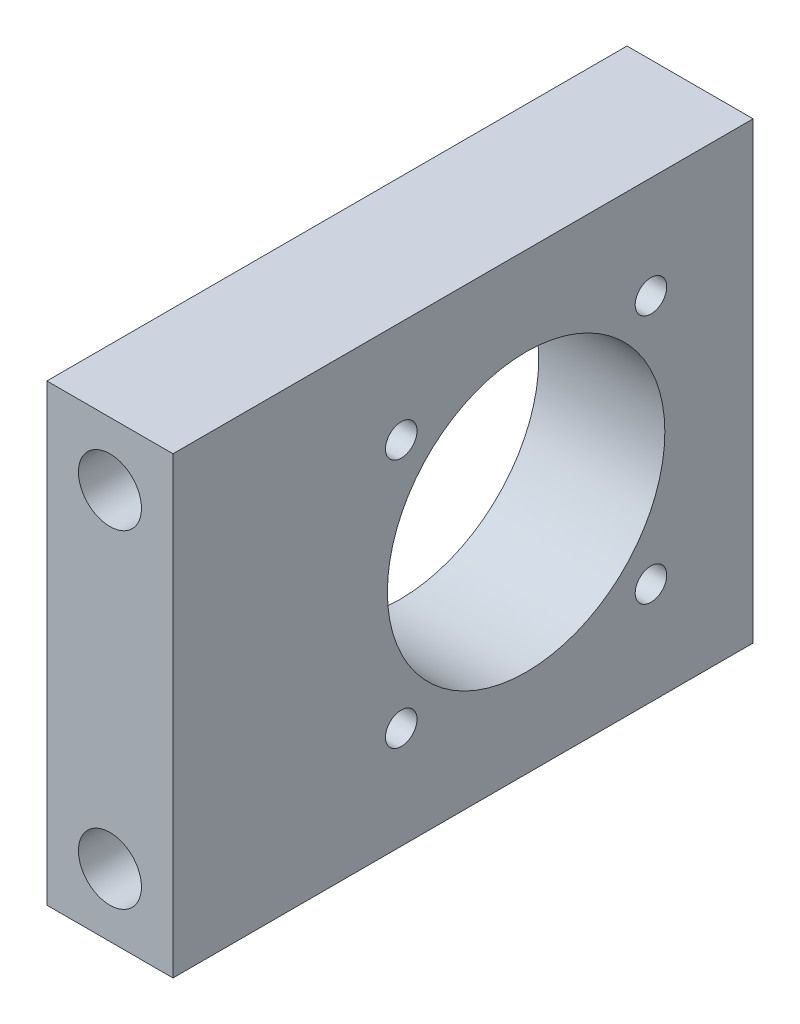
ISO-10303-21;
HEADER;
FILE_DESCRIPTION(('STEP AP214'),'2;1');
FILE_NAME('part.step','',(''),(''),'','','');
FILE_SCHEMA(('AUTOMOTIVE_DESIGN { 1 0 10303 214 1 1 1 1 }'));
ENDSEC;
DATA;
#1=APPLICATION_CONTEXT('core data for automotive mechanical design processes');
#2=APPLICATION_PROTOCOL_DEFINITION('international standard','automotive_design',2000,#1);
#3=PRODUCT_CONTEXT('',#1,'mechanical');
#4=PRODUCT('Part','Part','',(#3));
#5=PRODUCT_RELATED_PRODUCT_CATEGORY('part','',(#4));
#6=PRODUCT_DEFINITION_FORMATION('','',#4);
#7=PRODUCT_DEFINITION_CONTEXT('part definition',#1,'design');
#8=PRODUCT_DEFINITION('design','',#6,#7);
#9=PRODUCT_DEFINITION_SHAPE('','',#8);
#10=(LENGTH_UNIT() NAMED_UNIT(*) SI_UNIT(.MILLI.,.METRE.));
#11=(NAMED_UNIT(*) PLANE_ANGLE_UNIT() SI_UNIT($,.RADIAN.));
#12=(NAMED_UNIT(*) SI_UNIT($,.STERADIAN.) SOLID_ANGLE_UNIT());
#13=UNCERTAINTY_MEASURE_WITH_UNIT(LENGTH_MEASURE(1.E-05),#10,'distance_accuracy_value','');
#14=(GEOMETRIC_REPRESENTATION_CONTEXT(3) GLOBAL_UNCERTAINTY_ASSIGNED_CONTEXT((#13)) GLOBAL_UNIT_ASSIGNED_CONTEXT((#10,
#11,#12)) REPRESENTATION_CONTEXT('',''));
#15=CARTESIAN_POINT('',(0.,0.,0.));
#16=DIRECTION('',(0.,0.,1.));
#17=DIRECTION('',(1.,0.,0.));
#18=AXIS2_PLACEMENT_3D('',#15,#16,#17);
#19=CARTESIAN_POINT('',(10.,0.,0.));
#20=DIRECTION('',(1.,0.,0.));
#21=DIRECTION('',(0.,0.,-1.));
#22=AXIS2_PLACEMENT_3D('',#19,#20,#21);
#23=PLANE('',#22);
#24=CARTESIAN_POINT('',(10.,-9.89949493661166,-9.89949493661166));
#25=DIRECTION('',(1.,0.,0.));
#26=DIRECTION('',(0.,0.,-1.));
#27=AXIS2_PLACEMENT_3D('',#24,#25,#26);
#28=CIRCLE('',#27,1.24999999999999);
#29=CARTESIAN_POINT('',(10.,-9.89949493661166,-11.1494949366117));
#30=VERTEX_POINT('',#29);
#31=EDGE_CURVE('E199',#30,#30,#28,.T.);
#32=ORIENTED_EDGE('',*,*,#31,.F.);
#33=EDGE_LOOP('',(#32));
#34=FACE_BOUND('',#33,.T.);
#35=CARTESIAN_POINT('',(10.,-9.89949493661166,9.89949493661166));
#36=DIRECTION('',(1.,0.,0.));
#37=DIRECTION('',(0.,0.,-1.));
#38=AXIS2_PLACEMENT_3D('',#35,#36,#37);
#39=CIRCLE('',#38,1.24999999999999);
#40=CARTESIAN_POINT('',(10.,-9.89949493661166,8.64949493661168));
#41=VERTEX_POINT('',#40);
#42=EDGE_CURVE('E201',#41,#41,#39,.T.);
#43=ORIENTED_EDGE('',*,*,#42,.F.);
#44=EDGE_LOOP('',(#43));
#45=FACE_BOUND('',#44,.T.);
#46=CARTESIAN_POINT('',(10.,9.89949493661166,9.89949493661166));
#47=DIRECTION('',(1.,0.,0.));
#48=DIRECTION('',(0.,0.,-1.));
#49=AXIS2_PLACEMENT_3D('',#46,#47,#48);
#50=CIRCLE('',#49,1.24999999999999);
#51=CARTESIAN_POINT('',(10.,9.89949493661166,8.64949493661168));
#52=VERTEX_POINT('',#51);
#53=EDGE_CURVE('E209',#52,#52,#50,.T.);
#54=ORIENTED_EDGE('',*,*,#53,.F.);
#55=EDGE_LOOP('',(#54));
#56=FACE_BOUND('',#55,.T.);
#57=CARTESIAN_POINT('',(10.,9.89949493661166,-9.89949493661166));
#58=DIRECTION('',(1.,0.,0.));
#59=DIRECTION('',(0.,0.,-1.));
#60=AXIS2_PLACEMENT_3D('',#57,#58,#59);
#61=CIRCLE('',#60,1.24999999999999);
#62=CARTESIAN_POINT('',(10.,9.89949493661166,-11.1494949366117));
#63=VERTEX_POINT('',#62);
#64=EDGE_CURVE('E215',#63,#63,#61,.T.);
#65=ORIENTED_EDGE('',*,*,#64,.F.);
#66=EDGE_LOOP('',(#65));
#67=FACE_BOUND('',#66,.T.);
#68=DIRECTION('',(0.,-1.,0.));
#69=VECTOR('',#68,1.);
#70=CARTESIAN_POINT('',(10.,18.,28.));
#71=LINE('',#70,#69);
#72=CARTESIAN_POINT('',(10.,18.,28.));
#73=VERTEX_POINT('',#72);
#74=CARTESIAN_POINT('',(10.,-18.,28.));
#75=VERTEX_POINT('',#74);
#76=EDGE_CURVE('E121',#73,#75,#71,.T.);
#77=ORIENTED_EDGE('',*,*,#76,.T.);
#78=DIRECTION('',(0.,0.,-1.));
#79=VECTOR('',#78,1.);
#80=CARTESIAN_POINT('',(10.,-18.,28.));
#81=LINE('',#80,#79);
#82=CARTESIAN_POINT('',(10.,-18.,-18.));
#83=VERTEX_POINT('',#82);
#84=EDGE_CURVE('E84',#75,#83,#81,.T.);
#85=ORIENTED_EDGE('',*,*,#84,.T.);
#86=DIRECTION('',(0.,1.,0.));
#87=VECTOR('',#86,1.);
#88=CARTESIAN_POINT('',(10.,-18.,-18.));
#89=LINE('',#88,#87);
#90=CARTESIAN_POINT('',(10.,18.,-18.));
#91=VERTEX_POINT('',#90);
#92=EDGE_CURVE('E124',#83,#91,#89,.T.);
#93=ORIENTED_EDGE('',*,*,#92,.T.);
#94=DIRECTION('',(0.,0.,1.));
#95=VECTOR('',#94,1.);
#96=CARTESIAN_POINT('',(10.,18.,-18.));
#97=LINE('',#96,#95);
#98=EDGE_CURVE('E53',#91,#73,#97,.T.);
#99=ORIENTED_EDGE('',*,*,#98,.T.);
#100=EDGE_LOOP('',(#77,#85,#93,#99));
#101=FACE_BOUND('',#100,.T.);
#102=CARTESIAN_POINT('',(10.,0.,0.));
#103=DIRECTION('',(1.,0.,0.));
#104=DIRECTION('',(0.,0.,-1.));
#105=AXIS2_PLACEMENT_3D('',#102,#103,#104);
#106=CIRCLE('',#105,11.);
#107=CARTESIAN_POINT('',(10.,0.,-11.));
#108=VERTEX_POINT('',#107);
#109=EDGE_CURVE('E115',#108,#108,#106,.T.);
#110=ORIENTED_EDGE('',*,*,#109,.F.);
#111=EDGE_LOOP('',(#110));
#112=FACE_BOUND('',#111,.T.);
#113=ADVANCED_FACE('F36',(#34,#45,#56,#67,#101,#112),#23,.T.);
#114=CARTESIAN_POINT('',(0.,0.,0.));
#115=DIRECTION('',(1.,0.,0.));
#116=DIRECTION('',(0.,0.,-1.));
#117=AXIS2_PLACEMENT_3D('',#114,#115,#116);
#118=PLANE('',#117);
#119=CARTESIAN_POINT('',(0.,-9.89949493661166,-9.89949493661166));
#120=DIRECTION('',(1.,0.,0.));
#121=DIRECTION('',(0.,0.,-1.));
#122=AXIS2_PLACEMENT_3D('',#119,#120,#121);
#123=CIRCLE('',#122,1.25);
#124=CARTESIAN_POINT('',(0.,-9.89949493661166,-11.1494949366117));
#125=VERTEX_POINT('',#124);
#126=EDGE_CURVE('E197',#125,#125,#123,.T.);
#127=ORIENTED_EDGE('',*,*,#126,.T.);
#128=EDGE_LOOP('',(#127));
#129=FACE_BOUND('',#128,.T.);
#130=CARTESIAN_POINT('',(0.,-9.89949493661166,9.89949493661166));
#131=DIRECTION('',(1.,0.,0.));
#132=DIRECTION('',(0.,0.,-1.));
#133=AXIS2_PLACEMENT_3D('',#130,#131,#132);
#134=CIRCLE('',#133,1.25);
#135=CARTESIAN_POINT('',(0.,-9.89949493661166,8.64949493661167));
#136=VERTEX_POINT('',#135);
#137=EDGE_CURVE('E206',#136,#136,#134,.T.);
#138=ORIENTED_EDGE('',*,*,#137,.T.);
#139=EDGE_LOOP('',(#138));
#140=FACE_BOUND('',#139,.T.);
#141=CARTESIAN_POINT('',(0.,9.89949493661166,9.89949493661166));
#142=DIRECTION('',(1.,0.,0.));
#143=DIRECTION('',(0.,0.,-1.));
#144=AXIS2_PLACEMENT_3D('',#141,#142,#143);
#145=CIRCLE('',#144,1.25);
#146=CARTESIAN_POINT('',(0.,9.89949493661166,8.64949493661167));
#147=VERTEX_POINT('',#146);
#148=EDGE_CURVE('E212',#147,#147,#145,.T.);
#149=ORIENTED_EDGE('',*,*,#148,.T.);
#150=EDGE_LOOP('',(#149));
#151=FACE_BOUND('',#150,.T.);
#152=CARTESIAN_POINT('',(0.,9.89949493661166,-9.89949493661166));
#153=DIRECTION('',(1.,0.,0.));
#154=DIRECTION('',(0.,0.,-1.));
#155=AXIS2_PLACEMENT_3D('',#152,#153,#154);
#156=CIRCLE('',#155,1.25);
#157=CARTESIAN_POINT('',(0.,9.89949493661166,-11.1494949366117));
#158=VERTEX_POINT('',#157);
#159=EDGE_CURVE('E108',#158,#158,#156,.T.);
#160=ORIENTED_EDGE('',*,*,#159,.T.);
#161=EDGE_LOOP('',(#160));
#162=FACE_BOUND('',#161,.T.);
#163=DIRECTION('',(0.,-1.,0.));
#164=VECTOR('',#163,1.);
#165=CARTESIAN_POINT('',(0.,18.,28.));
#166=LINE('',#165,#164);
#167=CARTESIAN_POINT('',(0.,18.,28.));
#168=VERTEX_POINT('',#167);
#169=CARTESIAN_POINT('',(0.,-18.,28.));
#170=VERTEX_POINT('',#169);
#171=EDGE_CURVE('E118',#168,#170,#166,.T.);
#172=ORIENTED_EDGE('',*,*,#171,.F.);
#173=DIRECTION('',(0.,0.,1.));
#174=VECTOR('',#173,1.);
#175=CARTESIAN_POINT('',(0.,18.,-18.));
#176=LINE('',#175,#174);
#177=CARTESIAN_POINT('',(0.,18.,-18.));
#178=VERTEX_POINT('',#177);
#179=EDGE_CURVE('E77',#178,#168,#176,.T.);
#180=ORIENTED_EDGE('',*,*,#179,.F.);
#181=DIRECTION('',(0.,1.,0.));
#182=VECTOR('',#181,1.);
#183=CARTESIAN_POINT('',(0.,-18.,-18.));
#184=LINE('',#183,#182);
#185=CARTESIAN_POINT('',(0.,-18.,-18.));
#186=VERTEX_POINT('',#185);
#187=EDGE_CURVE('E71',#186,#178,#184,.T.);
#188=ORIENTED_EDGE('',*,*,#187,.F.);
#189=DIRECTION('',(0.,0.,-1.));
#190=VECTOR('',#189,1.);
#191=CARTESIAN_POINT('',(0.,-18.,28.));
#192=LINE('',#191,#190);
#193=EDGE_CURVE('E130',#170,#186,#192,.T.);
#194=ORIENTED_EDGE('',*,*,#193,.F.);
#195=EDGE_LOOP('',(#172,#180,#188,#194));
#196=FACE_BOUND('',#195,.T.);
#197=CARTESIAN_POINT('',(0.,0.,0.));
#198=DIRECTION('',(1.,0.,0.));
#199=DIRECTION('',(0.,0.,-1.));
#200=AXIS2_PLACEMENT_3D('',#197,#198,#199);
#201=CIRCLE('',#200,11.);
#202=CARTESIAN_POINT('',(0.,0.,-11.));
#203=VERTEX_POINT('',#202);
#204=EDGE_CURVE('E114',#203,#203,#201,.T.);
#205=ORIENTED_EDGE('',*,*,#204,.T.);
#206=EDGE_LOOP('',(#205));
#207=FACE_BOUND('',#206,.T.);
#208=ADVANCED_FACE('F140',(#129,#140,#151,#162,#196,#207),#118,.F.);
#209=CARTESIAN_POINT('',(10.,18.,28.));
#210=DIRECTION('',(0.,0.,-1.));
#211=DIRECTION('',(0.,1.,0.));
#212=AXIS2_PLACEMENT_3D('',#209,#210,#211);
#213=PLANE('',#212);
#214=CARTESIAN_POINT('',(5.,13.,28.));
#215=DIRECTION('',(0.,0.,1.));
#216=DIRECTION('',(1.,0.,0.));
#217=AXIS2_PLACEMENT_3D('',#214,#215,#216);
#218=CIRCLE('',#217,2.5);
#219=CARTESIAN_POINT('',(7.5,13.,28.));
#220=VERTEX_POINT('',#219);
#221=EDGE_CURVE('E102',#220,#220,#218,.T.);
#222=ORIENTED_EDGE('',*,*,#221,.F.);
#223=EDGE_LOOP('',(#222));
#224=FACE_BOUND('',#223,.T.);
#225=CARTESIAN_POINT('',(5.,-13.,28.));
#226=DIRECTION('',(0.,0.,1.));
#227=DIRECTION('',(1.,0.,0.));
#228=AXIS2_PLACEMENT_3D('',#225,#226,#227);
#229=CIRCLE('',#228,2.5);
#230=CARTESIAN_POINT('',(7.5,-13.,28.));
#231=VERTEX_POINT('',#230);
#232=EDGE_CURVE('E101',#231,#231,#229,.T.);
#233=ORIENTED_EDGE('',*,*,#232,.F.);
#234=EDGE_LOOP('',(#233));
#235=FACE_BOUND('',#234,.T.);
#236=ORIENTED_EDGE('',*,*,#171,.T.);
#237=DIRECTION('',(-1.,0.,0.));
#238=VECTOR('',#237,1.);
#239=CARTESIAN_POINT('',(10.,-18.,28.));
#240=LINE('',#239,#238);
#241=EDGE_CURVE('E11',#75,#170,#240,.T.);
#242=ORIENTED_EDGE('',*,*,#241,.F.);
#243=ORIENTED_EDGE('',*,*,#76,.F.);
#244=DIRECTION('',(-1.,0.,0.));
#245=VECTOR('',#244,1.);
#246=CARTESIAN_POINT('',(10.,18.,28.));
#247=LINE('',#246,#245);
#248=EDGE_CURVE('E127',#73,#168,#247,.T.);
#249=ORIENTED_EDGE('',*,*,#248,.T.);
#250=EDGE_LOOP('',(#236,#242,#243,#249));
#251=FACE_BOUND('',#250,.T.);
#252=ADVANCED_FACE('F38',(#224,#235,#251),#213,.F.);
#253=CARTESIAN_POINT('',(10.,-18.,28.));
#254=DIRECTION('',(0.,1.,0.));
#255=DIRECTION('',(0.,0.,1.));
#256=AXIS2_PLACEMENT_3D('',#253,#254,#255);
#257=PLANE('',#256);
#258=ORIENTED_EDGE('',*,*,#193,.T.);
#259=DIRECTION('',(-1.,0.,0.));
#260=VECTOR('',#259,1.);
#261=CARTESIAN_POINT('',(10.,-18.,-18.));
#262=LINE('',#261,#260);
#263=EDGE_CURVE('E45',#83,#186,#262,.T.);
#264=ORIENTED_EDGE('',*,*,#263,.F.);
#265=ORIENTED_EDGE('',*,*,#84,.F.);
#266=ORIENTED_EDGE('',*,*,#241,.T.);
#267=EDGE_LOOP('',(#258,#264,#265,#266));
#268=FACE_BOUND('',#267,.T.);
#269=ADVANCED_FACE('F156',(#268),#257,.F.);
#270=CARTESIAN_POINT('',(10.,-18.,-18.));
#271=DIRECTION('',(0.,0.,1.));
#272=DIRECTION('',(1.,0.,0.));
#273=AXIS2_PLACEMENT_3D('',#270,#271,#272);
#274=PLANE('',#273);
#275=ORIENTED_EDGE('',*,*,#187,.T.);
#276=DIRECTION('',(-1.,0.,0.));
#277=VECTOR('',#276,1.);
#278=CARTESIAN_POINT('',(10.,18.,-18.));
#279=LINE('',#278,#277);
#280=EDGE_CURVE('E135',#91,#178,#279,.T.);
#281=ORIENTED_EDGE('',*,*,#280,.F.);
#282=ORIENTED_EDGE('',*,*,#92,.F.);
#283=ORIENTED_EDGE('',*,*,#263,.T.);
#284=EDGE_LOOP('',(#275,#281,#282,#283));
#285=FACE_BOUND('',#284,.T.);
#286=ADVANCED_FACE('F137',(#285),#274,.F.);
#287=CARTESIAN_POINT('',(10.,18.,-18.));
#288=DIRECTION('',(0.,-1.,0.));
#289=DIRECTION('',(0.,0.,-1.));
#290=AXIS2_PLACEMENT_3D('',#287,#288,#289);
#291=PLANE('',#290);
#292=ORIENTED_EDGE('',*,*,#179,.T.);
#293=ORIENTED_EDGE('',*,*,#248,.F.);
#294=ORIENTED_EDGE('',*,*,#98,.F.);
#295=ORIENTED_EDGE('',*,*,#280,.T.);
#296=EDGE_LOOP('',(#292,#293,#294,#295));
#297=FACE_BOUND('',#296,.T.);
#298=ADVANCED_FACE('F145',(#297),#291,.F.);
#299=CARTESIAN_POINT('',(10.,0.,0.));
#300=DIRECTION('',(-1.,0.,0.));
#301=DIRECTION('',(0.,0.,1.));
#302=AXIS2_PLACEMENT_3D('',#299,#300,#301);
#303=CYLINDRICAL_SURFACE('',#302,11.);
#304=ORIENTED_EDGE('',*,*,#109,.T.);
#305=EDGE_LOOP('',(#304));
#306=FACE_BOUND('',#305,.T.);
#307=ORIENTED_EDGE('',*,*,#204,.F.);
#308=EDGE_LOOP('',(#307));
#309=FACE_BOUND('',#308,.T.);
#310=ADVANCED_FACE('F147',(#306,#309),#303,.F.);
#311=CARTESIAN_POINT('',(5.,-13.,13.));
#312=DIRECTION('',(0.,0.,1.));
#313=DIRECTION('',(1.,0.,0.));
#314=AXIS2_PLACEMENT_3D('',#311,#312,#313);
#315=CONICAL_SURFACE('',#314,2.5,1.02974425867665);
#316=CARTESIAN_POINT('',(5.,-13.,11.4978484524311));
#317=VERTEX_POINT('',#316);
#318=VERTEX_LOOP('',#317);
#319=FACE_BOUND('',#318,.T.);
#320=CARTESIAN_POINT('',(5.,-13.,13.));
#321=DIRECTION('',(0.,0.,1.));
#322=DIRECTION('',(1.,0.,0.));
#323=AXIS2_PLACEMENT_3D('',#320,#321,#322);
#324=CIRCLE('',#323,2.5);
#325=CARTESIAN_POINT('',(7.5,-13.,13.));
#326=VERTEX_POINT('',#325);
#327=EDGE_CURVE('E105',#326,#326,#324,.T.);
#328=ORIENTED_EDGE('',*,*,#327,.T.);
#329=EDGE_LOOP('',(#328));
#330=FACE_BOUND('',#329,.T.);
#331=ADVANCED_FACE('F153',(#319,#330),#315,.F.);
#332=CARTESIAN_POINT('',(5.,-13.,28.));
#333=DIRECTION('',(0.,0.,1.));
#334=DIRECTION('',(1.,0.,0.));
#335=AXIS2_PLACEMENT_3D('',#332,#333,#334);
#336=CYLINDRICAL_SURFACE('',#335,2.5);
#337=ORIENTED_EDGE('',*,*,#327,.F.);
#338=EDGE_LOOP('',(#337));
#339=FACE_BOUND('',#338,.T.);
#340=ORIENTED_EDGE('',*,*,#232,.T.);
#341=EDGE_LOOP('',(#340));
#342=FACE_BOUND('',#341,.T.);
#343=ADVANCED_FACE('F95',(#339,#342),#336,.F.);
#344=CARTESIAN_POINT('',(5.,13.,13.));
#345=DIRECTION('',(0.,0.,1.));
#346=DIRECTION('',(1.,0.,0.));
#347=AXIS2_PLACEMENT_3D('',#344,#345,#346);
#348=CONICAL_SURFACE('',#347,2.5,1.02974425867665);
#349=CARTESIAN_POINT('',(4.99999999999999,13.,11.4978484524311));
#350=VERTEX_POINT('',#349);
#351=VERTEX_LOOP('',#350);
#352=FACE_BOUND('',#351,.T.);
#353=CARTESIAN_POINT('',(5.,13.,13.));
#354=DIRECTION('',(0.,0.,1.));
#355=DIRECTION('',(1.,0.,0.));
#356=AXIS2_PLACEMENT_3D('',#353,#354,#355);
#357=CIRCLE('',#356,2.5);
#358=CARTESIAN_POINT('',(7.49999999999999,13.,13.));
#359=VERTEX_POINT('',#358);
#360=EDGE_CURVE('E99',#359,#359,#357,.T.);
#361=ORIENTED_EDGE('',*,*,#360,.T.);
#362=EDGE_LOOP('',(#361));
#363=FACE_BOUND('',#362,.T.);
#364=ADVANCED_FACE('F91',(#352,#363),#348,.F.);
#365=CARTESIAN_POINT('',(5.,13.,28.));
#366=DIRECTION('',(0.,0.,1.));
#367=DIRECTION('',(1.,0.,0.));
#368=AXIS2_PLACEMENT_3D('',#365,#366,#367);
#369=CYLINDRICAL_SURFACE('',#368,2.5);
#370=ORIENTED_EDGE('',*,*,#360,.F.);
#371=EDGE_LOOP('',(#370));
#372=FACE_BOUND('',#371,.T.);
#373=ORIENTED_EDGE('',*,*,#221,.T.);
#374=EDGE_LOOP('',(#373));
#375=FACE_BOUND('',#374,.T.);
#376=ADVANCED_FACE('F94',(#372,#375),#369,.F.);
#377=CARTESIAN_POINT('',(10.,9.89949493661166,-9.89949493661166));
#378=DIRECTION('',(1.,0.,0.));
#379=DIRECTION('',(0.,0.,-1.));
#380=AXIS2_PLACEMENT_3D('',#377,#378,#379);
#381=CYLINDRICAL_SURFACE('',#380,1.24999999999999);
#382=ORIENTED_EDGE('',*,*,#159,.F.);
#383=EDGE_LOOP('',(#382));
#384=FACE_BOUND('',#383,.T.);
#385=ORIENTED_EDGE('',*,*,#64,.T.);
#386=EDGE_LOOP('',(#385));
#387=FACE_BOUND('',#386,.T.);
#388=ADVANCED_FACE('F177',(#384,#387),#381,.F.);
#389=CARTESIAN_POINT('',(10.,9.89949493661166,9.89949493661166));
#390=DIRECTION('',(1.,0.,0.));
#391=DIRECTION('',(0.,0.,-1.));
#392=AXIS2_PLACEMENT_3D('',#389,#390,#391);
#393=CYLINDRICAL_SURFACE('',#392,1.24999999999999);
#394=ORIENTED_EDGE('',*,*,#148,.F.);
#395=EDGE_LOOP('',(#394));
#396=FACE_BOUND('',#395,.T.);
#397=ORIENTED_EDGE('',*,*,#53,.T.);
#398=EDGE_LOOP('',(#397));
#399=FACE_BOUND('',#398,.T.);
#400=ADVANCED_FACE('F180',(#396,#399),#393,.F.);
#401=CARTESIAN_POINT('',(10.,-9.89949493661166,9.89949493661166));
#402=DIRECTION('',(1.,0.,0.));
#403=DIRECTION('',(0.,0.,-1.));
#404=AXIS2_PLACEMENT_3D('',#401,#402,#403);
#405=CYLINDRICAL_SURFACE('',#404,1.24999999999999);
#406=ORIENTED_EDGE('',*,*,#137,.F.);
#407=EDGE_LOOP('',(#406));
#408=FACE_BOUND('',#407,.T.);
#409=ORIENTED_EDGE('',*,*,#42,.T.);
#410=EDGE_LOOP('',(#409));
#411=FACE_BOUND('',#410,.T.);
#412=ADVANCED_FACE('F184',(#408,#411),#405,.F.);
#413=CARTESIAN_POINT('',(10.,-9.89949493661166,-9.89949493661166));
#414=DIRECTION('',(1.,0.,0.));
#415=DIRECTION('',(0.,0.,-1.));
#416=AXIS2_PLACEMENT_3D('',#413,#414,#415);
#417=CYLINDRICAL_SURFACE('',#416,1.24999999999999);
#418=ORIENTED_EDGE('',*,*,#126,.F.);
#419=EDGE_LOOP('',(#418));
#420=FACE_BOUND('',#419,.T.);
#421=ORIENTED_EDGE('',*,*,#31,.T.);
#422=EDGE_LOOP('',(#421));
#423=FACE_BOUND('',#422,.T.);
#424=ADVANCED_FACE('F188',(#420,#423),#417,.F.);
#425=CLOSED_SHELL('',(#113,#208,#252,#269,#286,#298,#310,#331,#343,#364,#376,#388,#400,#412,#424));
#426=MANIFOLD_SOLID_BREP('B2',#425);
#427=ADVANCED_BREP_SHAPE_REPRESENTATION('',(#18,#426),#14);
#428=SHAPE_DEFINITION_REPRESENTATION(#9,#427);
ENDSEC;
END-ISO-10303-21;
